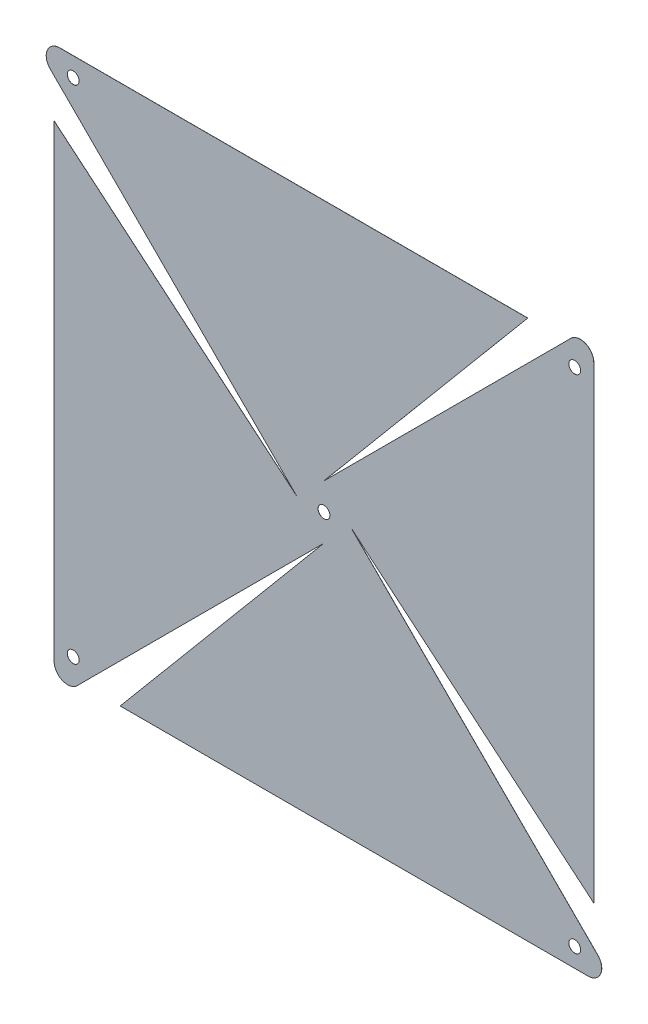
from build123d import *

# Parameters (mm, degrees)
SKETCH1_R           = 1.3890625
BOSS_EXTRUDE1_DEPTH = 0.0254
FILLET1_R           = 3.175


with BuildPart() as part:
    # Sketch1 → Boss-Extrude1 (new body)
    with BuildSketch(Plane.XY):
        Polygon((0, 6.35), (63.5, 69.85), (63.5, -47.954543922), (6.35, 0), (69.85, -63.5), (-47.954543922, -63.5), (0, -6.35), (-63.5, -69.85), (-63.5, 47.954543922), (-6.35, 0), (-69.85, 63.5), (47.954543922, 63.5), align=None)
        Circle(SKETCH1_R, mode=Mode.SUBTRACT)
        with Locations((59.009871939, 59.009871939)):
            Circle(SKETCH1_R, mode=Mode.SUBTRACT)
        with Locations((59.009871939, -59.009871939)):
            Circle(SKETCH1_R, mode=Mode.SUBTRACT)
        with Locations((-59.009871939, -59.009871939)):
            Circle(SKETCH1_R, mode=Mode.SUBTRACT)
        with Locations((-59.009871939, 59.009871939)):
            Circle(SKETCH1_R, mode=Mode.SUBTRACT)
    extrude(amount=BOSS_EXTRUDE1_DEPTH)

    # Fillet1
    fillet1_edges = [part.edges().sort_by_distance(p)[0] for p in [
        (63.5, 69.85, 0.0127),
        (69.85, -63.5, 0.0127),
        (-63.5, -69.85, 0.0127),
        (-69.85, 63.5, 0.0127),
    ]]
    fillet(fillet1_edges, radius=FILLET1_R)


solid = part.part
